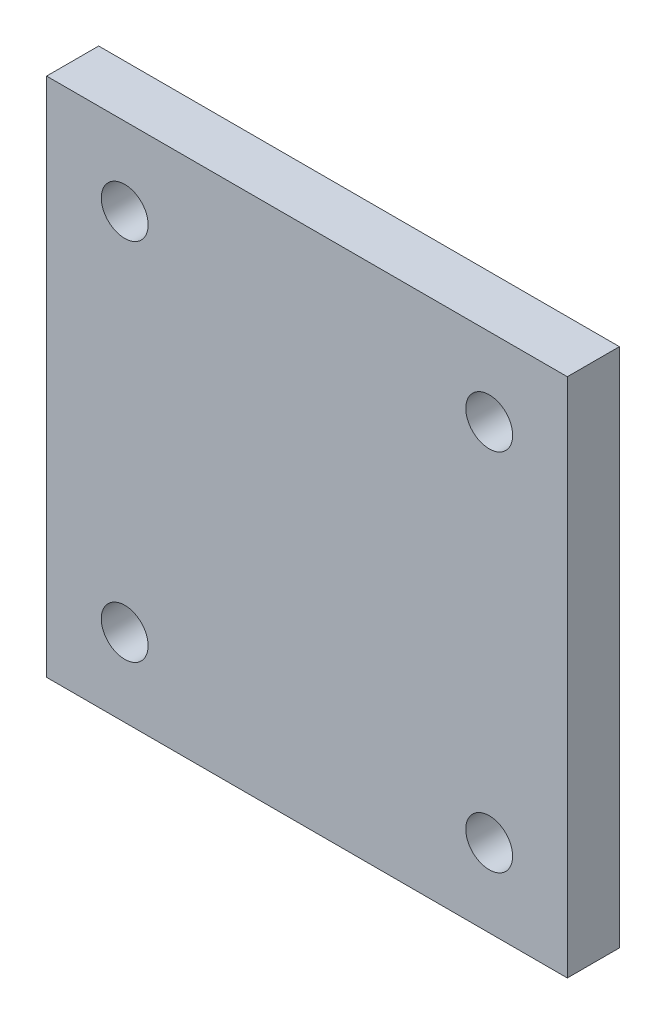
ISO-10303-21;
HEADER;
FILE_DESCRIPTION(('STEP AP214'),'2;1');
FILE_NAME('part.step','',(''),(''),'','','');
FILE_SCHEMA(('AUTOMOTIVE_DESIGN { 1 0 10303 214 1 1 1 1 }'));
ENDSEC;
DATA;
#1=APPLICATION_CONTEXT('core data for automotive mechanical design processes');
#2=APPLICATION_PROTOCOL_DEFINITION('international standard','automotive_design',2000,#1);
#3=PRODUCT_CONTEXT('',#1,'mechanical');
#4=PRODUCT('Part','Part','',(#3));
#5=PRODUCT_RELATED_PRODUCT_CATEGORY('part','',(#4));
#6=PRODUCT_DEFINITION_FORMATION('','',#4);
#7=PRODUCT_DEFINITION_CONTEXT('part definition',#1,'design');
#8=PRODUCT_DEFINITION('design','',#6,#7);
#9=PRODUCT_DEFINITION_SHAPE('','',#8);
#10=(LENGTH_UNIT() NAMED_UNIT(*) SI_UNIT(.MILLI.,.METRE.));
#11=(NAMED_UNIT(*) PLANE_ANGLE_UNIT() SI_UNIT($,.RADIAN.));
#12=(NAMED_UNIT(*) SI_UNIT($,.STERADIAN.) SOLID_ANGLE_UNIT());
#13=UNCERTAINTY_MEASURE_WITH_UNIT(LENGTH_MEASURE(1.E-05),#10,'distance_accuracy_value','');
#14=(GEOMETRIC_REPRESENTATION_CONTEXT(3) GLOBAL_UNCERTAINTY_ASSIGNED_CONTEXT((#13)) GLOBAL_UNIT_ASSIGNED_CONTEXT((#10,
#11,#12)) REPRESENTATION_CONTEXT('',''));
#15=CARTESIAN_POINT('',(0.,0.,0.));
#16=DIRECTION('',(0.,0.,1.));
#17=DIRECTION('',(1.,0.,0.));
#18=AXIS2_PLACEMENT_3D('',#15,#16,#17);
#19=CARTESIAN_POINT('',(0.,0.,20.));
#20=DIRECTION('',(0.,0.,1.));
#21=DIRECTION('',(1.,0.,0.));
#22=AXIS2_PLACEMENT_3D('',#19,#20,#21);
#23=PLANE('',#22);
#24=CARTESIAN_POINT('',(70.,70.,20.));
#25=DIRECTION('',(0.,0.,1.));
#26=DIRECTION('',(1.,0.,0.));
#27=AXIS2_PLACEMENT_3D('',#24,#25,#26);
#28=CIRCLE('',#27,9.);
#29=CARTESIAN_POINT('',(79.,70.,20.));
#30=VERTEX_POINT('',#29);
#31=EDGE_CURVE('E26',#30,#30,#28,.T.);
#32=ORIENTED_EDGE('',*,*,#31,.F.);
#33=EDGE_LOOP('',(#32));
#34=FACE_BOUND('',#33,.T.);
#35=CARTESIAN_POINT('',(70.,-70.,20.));
#36=DIRECTION('',(0.,0.,1.));
#37=DIRECTION('',(1.,0.,0.));
#38=AXIS2_PLACEMENT_3D('',#35,#36,#37);
#39=CIRCLE('',#38,9.);
#40=CARTESIAN_POINT('',(79.,-70.,20.));
#41=VERTEX_POINT('',#40);
#42=EDGE_CURVE('E78',#41,#41,#39,.T.);
#43=ORIENTED_EDGE('',*,*,#42,.F.);
#44=EDGE_LOOP('',(#43));
#45=FACE_BOUND('',#44,.T.);
#46=CARTESIAN_POINT('',(-70.,70.,20.));
#47=DIRECTION('',(0.,0.,1.));
#48=DIRECTION('',(1.,0.,0.));
#49=AXIS2_PLACEMENT_3D('',#46,#47,#48);
#50=CIRCLE('',#49,9.);
#51=CARTESIAN_POINT('',(-61.,70.,20.));
#52=VERTEX_POINT('',#51);
#53=EDGE_CURVE('E263',#52,#52,#50,.T.);
#54=ORIENTED_EDGE('',*,*,#53,.F.);
#55=EDGE_LOOP('',(#54));
#56=FACE_BOUND('',#55,.T.);
#57=CARTESIAN_POINT('',(-70.,-70.,20.));
#58=DIRECTION('',(0.,0.,1.));
#59=DIRECTION('',(1.,0.,0.));
#60=AXIS2_PLACEMENT_3D('',#57,#58,#59);
#61=CIRCLE('',#60,9.);
#62=CARTESIAN_POINT('',(-61.,-70.,20.));
#63=VERTEX_POINT('',#62);
#64=EDGE_CURVE('E248',#63,#63,#61,.T.);
#65=ORIENTED_EDGE('',*,*,#64,.F.);
#66=EDGE_LOOP('',(#65));
#67=FACE_BOUND('',#66,.T.);
#68=DIRECTION('',(1.,0.,0.));
#69=VECTOR('',#68,1.);
#70=CARTESIAN_POINT('',(-100.,-100.,20.));
#71=LINE('',#70,#69);
#72=CARTESIAN_POINT('',(-100.,-100.,20.));
#73=VERTEX_POINT('',#72);
#74=CARTESIAN_POINT('',(100.,-100.,20.));
#75=VERTEX_POINT('',#74);
#76=EDGE_CURVE('E242',#73,#75,#71,.T.);
#77=ORIENTED_EDGE('',*,*,#76,.T.);
#78=DIRECTION('',(0.,1.,0.));
#79=VECTOR('',#78,1.);
#80=CARTESIAN_POINT('',(100.,-100.,20.));
#81=LINE('',#80,#79);
#82=CARTESIAN_POINT('',(100.,100.,20.));
#83=VERTEX_POINT('',#82);
#84=EDGE_CURVE('E224',#75,#83,#81,.T.);
#85=ORIENTED_EDGE('',*,*,#84,.T.);
#86=DIRECTION('',(-1.,0.,0.));
#87=VECTOR('',#86,1.);
#88=CARTESIAN_POINT('',(100.,100.,20.));
#89=LINE('',#88,#87);
#90=CARTESIAN_POINT('',(-100.,100.,20.));
#91=VERTEX_POINT('',#90);
#92=EDGE_CURVE('E229',#83,#91,#89,.T.);
#93=ORIENTED_EDGE('',*,*,#92,.T.);
#94=DIRECTION('',(0.,-1.,0.));
#95=VECTOR('',#94,1.);
#96=CARTESIAN_POINT('',(-100.,100.,20.));
#97=LINE('',#96,#95);
#98=EDGE_CURVE('E258',#91,#73,#97,.T.);
#99=ORIENTED_EDGE('',*,*,#98,.T.);
#100=EDGE_LOOP('',(#77,#85,#93,#99));
#101=FACE_BOUND('',#100,.T.);
#102=ADVANCED_FACE('F16',(#34,#45,#56,#67,#101),#23,.T.);
#103=CARTESIAN_POINT('',(0.,0.,0.));
#104=DIRECTION('',(0.,0.,1.));
#105=DIRECTION('',(1.,0.,0.));
#106=AXIS2_PLACEMENT_3D('',#103,#104,#105);
#107=PLANE('',#106);
#108=CARTESIAN_POINT('',(70.,70.,0.));
#109=DIRECTION('',(0.,0.,1.));
#110=DIRECTION('',(1.,0.,0.));
#111=AXIS2_PLACEMENT_3D('',#108,#109,#110);
#112=CIRCLE('',#111,9.);
#113=CARTESIAN_POINT('',(79.,70.,0.));
#114=VERTEX_POINT('',#113);
#115=EDGE_CURVE('E10',#114,#114,#112,.T.);
#116=ORIENTED_EDGE('',*,*,#115,.T.);
#117=EDGE_LOOP('',(#116));
#118=FACE_BOUND('',#117,.T.);
#119=CARTESIAN_POINT('',(70.,-70.,0.));
#120=DIRECTION('',(0.,0.,1.));
#121=DIRECTION('',(1.,0.,0.));
#122=AXIS2_PLACEMENT_3D('',#119,#120,#121);
#123=CIRCLE('',#122,9.);
#124=CARTESIAN_POINT('',(79.,-70.,0.));
#125=VERTEX_POINT('',#124);
#126=EDGE_CURVE('E84',#125,#125,#123,.T.);
#127=ORIENTED_EDGE('',*,*,#126,.T.);
#128=EDGE_LOOP('',(#127));
#129=FACE_BOUND('',#128,.T.);
#130=CARTESIAN_POINT('',(-70.,70.,0.));
#131=DIRECTION('',(0.,0.,1.));
#132=DIRECTION('',(1.,0.,0.));
#133=AXIS2_PLACEMENT_3D('',#130,#131,#132);
#134=CIRCLE('',#133,9.);
#135=CARTESIAN_POINT('',(-61.,70.,0.));
#136=VERTEX_POINT('',#135);
#137=EDGE_CURVE('E92',#136,#136,#134,.T.);
#138=ORIENTED_EDGE('',*,*,#137,.T.);
#139=EDGE_LOOP('',(#138));
#140=FACE_BOUND('',#139,.T.);
#141=CARTESIAN_POINT('',(-70.,-70.,0.));
#142=DIRECTION('',(0.,0.,1.));
#143=DIRECTION('',(1.,0.,0.));
#144=AXIS2_PLACEMENT_3D('',#141,#142,#143);
#145=CIRCLE('',#144,9.);
#146=CARTESIAN_POINT('',(-61.,-70.,0.));
#147=VERTEX_POINT('',#146);
#148=EDGE_CURVE('E250',#147,#147,#145,.T.);
#149=ORIENTED_EDGE('',*,*,#148,.T.);
#150=EDGE_LOOP('',(#149));
#151=FACE_BOUND('',#150,.T.);
#152=DIRECTION('',(0.,-1.,0.));
#153=VECTOR('',#152,1.);
#154=CARTESIAN_POINT('',(-100.,100.,0.));
#155=LINE('',#154,#153);
#156=CARTESIAN_POINT('',(-100.,100.,0.));
#157=VERTEX_POINT('',#156);
#158=CARTESIAN_POINT('',(-100.,-100.,0.));
#159=VERTEX_POINT('',#158);
#160=EDGE_CURVE('E219',#157,#159,#155,.T.);
#161=ORIENTED_EDGE('',*,*,#160,.F.);
#162=DIRECTION('',(-1.,0.,0.));
#163=VECTOR('',#162,1.);
#164=CARTESIAN_POINT('',(100.,100.,0.));
#165=LINE('',#164,#163);
#166=CARTESIAN_POINT('',(100.,100.,0.));
#167=VERTEX_POINT('',#166);
#168=EDGE_CURVE('E213',#167,#157,#165,.T.);
#169=ORIENTED_EDGE('',*,*,#168,.F.);
#170=DIRECTION('',(0.,1.,0.));
#171=VECTOR('',#170,1.);
#172=CARTESIAN_POINT('',(100.,-100.,0.));
#173=LINE('',#172,#171);
#174=CARTESIAN_POINT('',(100.,-100.,0.));
#175=VERTEX_POINT('',#174);
#176=EDGE_CURVE('E217',#175,#167,#173,.T.);
#177=ORIENTED_EDGE('',*,*,#176,.F.);
#178=DIRECTION('',(1.,0.,0.));
#179=VECTOR('',#178,1.);
#180=CARTESIAN_POINT('',(-100.,-100.,0.));
#181=LINE('',#180,#179);
#182=EDGE_CURVE('E283',#159,#175,#181,.T.);
#183=ORIENTED_EDGE('',*,*,#182,.F.);
#184=EDGE_LOOP('',(#161,#169,#177,#183));
#185=FACE_BOUND('',#184,.T.);
#186=ADVANCED_FACE('F170',(#118,#129,#140,#151,#185),#107,.F.);
#187=CARTESIAN_POINT('',(70.,70.,0.));
#188=DIRECTION('',(0.,0.,-1.));
#189=DIRECTION('',(1.,0.,0.));
#190=AXIS2_PLACEMENT_3D('',#187,#188,#189);
#191=CYLINDRICAL_SURFACE('',#190,9.);
#192=DIRECTION('',(0.,0.,1.));
#193=VECTOR('',#192,1.);
#194=CARTESIAN_POINT('',(79.,70.,0.));
#195=LINE('',#194,#193);
#196=EDGE_CURVE('E90',#114,#30,#195,.T.);
#197=ORIENTED_EDGE('',*,*,#196,.T.);
#198=ORIENTED_EDGE('',*,*,#31,.T.);
#199=ORIENTED_EDGE('',*,*,#196,.F.);
#200=ORIENTED_EDGE('',*,*,#115,.F.);
#201=EDGE_LOOP('',(#197,#198,#199,#200));
#202=FACE_BOUND('',#201,.T.);
#203=ADVANCED_FACE('F18',(#202),#191,.F.);
#204=CARTESIAN_POINT('',(70.,-70.,0.));
#205=DIRECTION('',(0.,0.,-1.));
#206=DIRECTION('',(1.,0.,0.));
#207=AXIS2_PLACEMENT_3D('',#204,#205,#206);
#208=CYLINDRICAL_SURFACE('',#207,9.);
#209=DIRECTION('',(0.,0.,1.));
#210=VECTOR('',#209,1.);
#211=CARTESIAN_POINT('',(79.,-70.,0.));
#212=LINE('',#211,#210);
#213=EDGE_CURVE('E81',#125,#41,#212,.T.);
#214=ORIENTED_EDGE('',*,*,#213,.T.);
#215=ORIENTED_EDGE('',*,*,#42,.T.);
#216=ORIENTED_EDGE('',*,*,#213,.F.);
#217=ORIENTED_EDGE('',*,*,#126,.F.);
#218=EDGE_LOOP('',(#214,#215,#216,#217));
#219=FACE_BOUND('',#218,.T.);
#220=ADVANCED_FACE('F79',(#219),#208,.F.);
#221=CARTESIAN_POINT('',(-70.,70.,0.));
#222=DIRECTION('',(0.,0.,-1.));
#223=DIRECTION('',(1.,0.,0.));
#224=AXIS2_PLACEMENT_3D('',#221,#222,#223);
#225=CYLINDRICAL_SURFACE('',#224,9.);
#226=DIRECTION('',(0.,0.,1.));
#227=VECTOR('',#226,1.);
#228=CARTESIAN_POINT('',(-61.,70.,0.));
#229=LINE('',#228,#227);
#230=EDGE_CURVE('E257',#136,#52,#229,.T.);
#231=ORIENTED_EDGE('',*,*,#230,.T.);
#232=ORIENTED_EDGE('',*,*,#53,.T.);
#233=ORIENTED_EDGE('',*,*,#230,.F.);
#234=ORIENTED_EDGE('',*,*,#137,.F.);
#235=EDGE_LOOP('',(#231,#232,#233,#234));
#236=FACE_BOUND('',#235,.T.);
#237=ADVANCED_FACE('F138',(#236),#225,.F.);
#238=CARTESIAN_POINT('',(-70.,-70.,0.));
#239=DIRECTION('',(0.,0.,-1.));
#240=DIRECTION('',(1.,0.,0.));
#241=AXIS2_PLACEMENT_3D('',#238,#239,#240);
#242=CYLINDRICAL_SURFACE('',#241,9.);
#243=DIRECTION('',(0.,0.,1.));
#244=VECTOR('',#243,1.);
#245=CARTESIAN_POINT('',(-61.,-70.,0.));
#246=LINE('',#245,#244);
#247=EDGE_CURVE('E251',#147,#63,#246,.T.);
#248=ORIENTED_EDGE('',*,*,#247,.T.);
#249=ORIENTED_EDGE('',*,*,#64,.T.);
#250=ORIENTED_EDGE('',*,*,#247,.F.);
#251=ORIENTED_EDGE('',*,*,#148,.F.);
#252=EDGE_LOOP('',(#248,#249,#250,#251));
#253=FACE_BOUND('',#252,.T.);
#254=ADVANCED_FACE('F133',(#253),#242,.F.);
#255=CARTESIAN_POINT('',(-100.,100.,0.));
#256=DIRECTION('',(1.,0.,0.));
#257=DIRECTION('',(0.,1.,0.));
#258=AXIS2_PLACEMENT_3D('',#255,#256,#257);
#259=PLANE('',#258);
#260=ORIENTED_EDGE('',*,*,#160,.T.);
#261=DIRECTION('',(0.,0.,1.));
#262=VECTOR('',#261,1.);
#263=CARTESIAN_POINT('',(-100.,-100.,0.));
#264=LINE('',#263,#262);
#265=EDGE_CURVE('E237',#159,#73,#264,.T.);
#266=ORIENTED_EDGE('',*,*,#265,.T.);
#267=ORIENTED_EDGE('',*,*,#98,.F.);
#268=DIRECTION('',(0.,0.,1.));
#269=VECTOR('',#268,1.);
#270=CARTESIAN_POINT('',(-100.,100.,0.));
#271=LINE('',#270,#269);
#272=EDGE_CURVE('E223',#157,#91,#271,.T.);
#273=ORIENTED_EDGE('',*,*,#272,.F.);
#274=EDGE_LOOP('',(#260,#266,#267,#273));
#275=FACE_BOUND('',#274,.T.);
#276=ADVANCED_FACE('F127',(#275),#259,.F.);
#277=CARTESIAN_POINT('',(100.,100.,0.));
#278=DIRECTION('',(0.,-1.,0.));
#279=DIRECTION('',(0.,0.,-1.));
#280=AXIS2_PLACEMENT_3D('',#277,#278,#279);
#281=PLANE('',#280);
#282=ORIENTED_EDGE('',*,*,#168,.T.);
#283=ORIENTED_EDGE('',*,*,#272,.T.);
#284=ORIENTED_EDGE('',*,*,#92,.F.);
#285=DIRECTION('',(0.,0.,1.));
#286=VECTOR('',#285,1.);
#287=CARTESIAN_POINT('',(100.,100.,0.));
#288=LINE('',#287,#286);
#289=EDGE_CURVE('E227',#167,#83,#288,.T.);
#290=ORIENTED_EDGE('',*,*,#289,.F.);
#291=EDGE_LOOP('',(#282,#283,#284,#290));
#292=FACE_BOUND('',#291,.T.);
#293=ADVANCED_FACE('F118',(#292),#281,.F.);
#294=CARTESIAN_POINT('',(100.,-100.,0.));
#295=DIRECTION('',(-1.,0.,0.));
#296=DIRECTION('',(0.,0.,1.));
#297=AXIS2_PLACEMENT_3D('',#294,#295,#296);
#298=PLANE('',#297);
#299=ORIENTED_EDGE('',*,*,#176,.T.);
#300=ORIENTED_EDGE('',*,*,#289,.T.);
#301=ORIENTED_EDGE('',*,*,#84,.F.);
#302=DIRECTION('',(0.,0.,1.));
#303=VECTOR('',#302,1.);
#304=CARTESIAN_POINT('',(100.,-100.,0.));
#305=LINE('',#304,#303);
#306=EDGE_CURVE('E234',#175,#75,#305,.T.);
#307=ORIENTED_EDGE('',*,*,#306,.F.);
#308=EDGE_LOOP('',(#299,#300,#301,#307));
#309=FACE_BOUND('',#308,.T.);
#310=ADVANCED_FACE('F108',(#309),#298,.F.);
#311=CARTESIAN_POINT('',(-100.,-100.,0.));
#312=DIRECTION('',(0.,1.,0.));
#313=DIRECTION('',(1.,0.,0.));
#314=AXIS2_PLACEMENT_3D('',#311,#312,#313);
#315=PLANE('',#314);
#316=ORIENTED_EDGE('',*,*,#182,.T.);
#317=ORIENTED_EDGE('',*,*,#306,.T.);
#318=ORIENTED_EDGE('',*,*,#76,.F.);
#319=ORIENTED_EDGE('',*,*,#265,.F.);
#320=EDGE_LOOP('',(#316,#317,#318,#319));
#321=FACE_BOUND('',#320,.T.);
#322=ADVANCED_FACE('F103',(#321),#315,.F.);
#323=CLOSED_SHELL('',(#102,#186,#203,#220,#237,#254,#276,#293,#310,#322));
#324=MANIFOLD_SOLID_BREP('B1',#323);
#325=ADVANCED_BREP_SHAPE_REPRESENTATION('',(#18,#324),#14);
#326=SHAPE_DEFINITION_REPRESENTATION(#9,#325);
ENDSEC;
END-ISO-10303-21;
